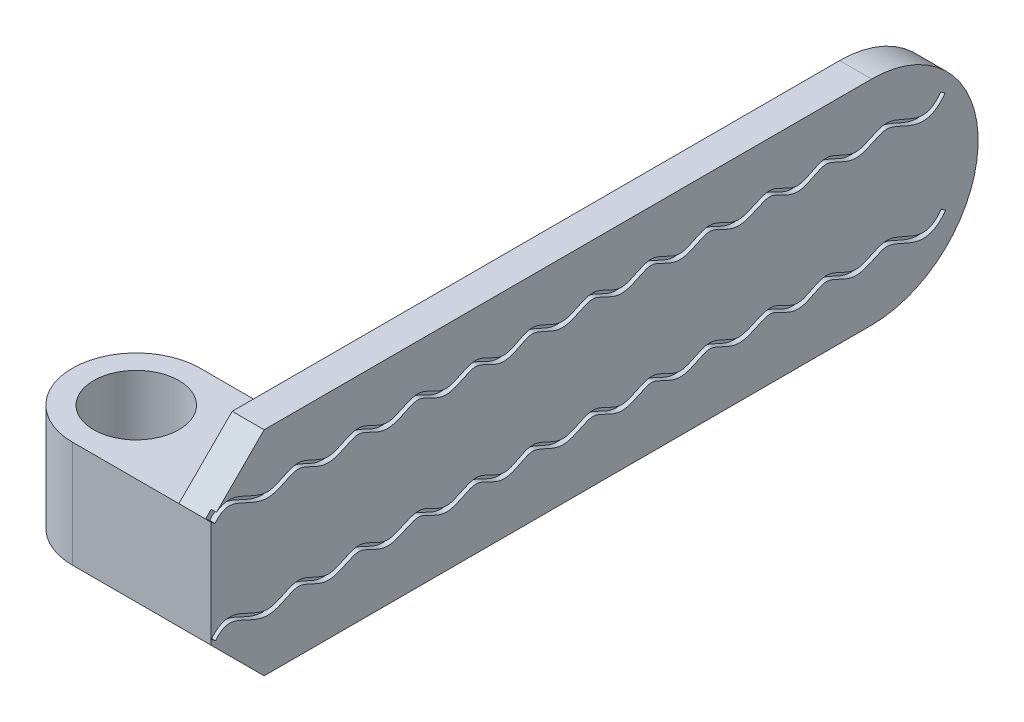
from build123d import *

# Parameters (mm, degrees)
SKETCH1_R                = 8
BOSS_EXTRUDE1_DEPTH      = 40
FILLET4_R                = 10
CUT_EXTRUDE11_DEPTH      = 155.20765221
CUT_EXTRUDE11_DEPTH_BACK = 155.20765221
CUT_EXTRUDE12_DEPTH      = 10
CUT_EXTRUDE13_START      = -20
CUT_EXTRUDE13_DEPTH      = 10
CHAMFER1_SIZE            = 10
CUT_EXTRUDE14_DEPTH      = 1
CUT_EXTRUDE18_DEPTH      = 1


with BuildPart() as part:
    # Sketch1 → Boss-Extrude1 (new body)
    with BuildSketch(Plane(origin=(0, 0, 0), x_dir=(1, 0, 0), z_dir=(0, 1, 0))):
        with BuildLine():
            Line((0, 0), (0, 144))
            Line((0, 144), (-6, 144))
            Line((-6, 144), (-6, 24))
            Line((-6, 24), (-26, 24))
            ThreePointArc((-26, 24), (-38, 12), (-26, 0))
            Line((-26, 0), (0, 0))
        make_face()
        with Locations(Location((-26, 12, 0), (0, 0, 270))):
            Circle(SKETCH1_R, mode=Mode.SUBTRACT)
    extrude(amount=BOSS_EXTRUDE1_DEPTH)

    # Fillet4
    fillet4_edges = [part.edges().sort_by_distance(p)[0] for p in [
        (-6, 20, -24),
    ]]
    fillet(fillet4_edges, radius=FILLET4_R)

    # Sketch15 → Cut-Extrude11 (cut, two sides: drawn at the far end of the back side and taken through both)
    with BuildSketch(Plane(origin=(0, 0, 0), x_dir=(0, 0, -1), z_dir=(1, 0, 0)).offset(-CUT_EXTRUDE11_DEPTH_BACK)):
        with BuildLine():
            Line((144, 40), (124, 40))
            ThreePointArc((124, 40), (138.142135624, 34.142135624), (144, 20))
            Line((144, 20), (144, 40))
        make_face()
        with BuildLine():
            ThreePointArc((144, 20), (138.142135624, 5.857864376), (124, 0))
            Line((124, 0), (144, 0))
            Line((144, 0), (144, 20))
        make_face()
    extrude(amount=CUT_EXTRUDE11_DEPTH + CUT_EXTRUDE11_DEPTH_BACK, mode=Mode.SUBTRACT)

    # Sketch16 → Cut-Extrude12 (cut)
    with BuildSketch(Plane.XZ):
        with BuildLine():
            Line((-6, -34), (-6, 0))
            Line((-6, 0), (-26, 0))
            ThreePointArc((-26, 0), (-38, -12), (-26, -24))
            Line((-26, -24), (-16, -24))
            ThreePointArc((-16, -24), (-8.928932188, -26.928932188), (-6, -34))
        make_face()
    extrude(amount=-CUT_EXTRUDE12_DEPTH, mode=Mode.SUBTRACT)

    # Sketch19 → Cut-Extrude13 (cut)
    with BuildSketch(Plane.XZ.offset(-10).offset(CUT_EXTRUDE13_START)):
        with BuildLine():
            Line((-6, -34), (-6, 0))
            Line((-6, 0), (-26, 0))
            ThreePointArc((-26, 0), (-38, -12), (-26, -24))
            Line((-26, -24), (-16, -24))
            ThreePointArc((-16, -24), (-8.928932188, -26.928932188), (-6, -34))
        make_face()
    extrude(amount=-CUT_EXTRUDE13_DEPTH, mode=Mode.SUBTRACT)

    # Chamfer1
    chamfer1_edges = [part.edges().sort_by_distance(p)[0] for p in [
        (-3, 0, 0),
        (-3, 40, 0),
    ]]
    chamfer(chamfer1_edges, length=CHAMFER1_SIZE)

    # Sketch20 → Cut-Extrude14 (cut)
    with BuildSketch(Plane(origin=(0, 0, 0), x_dir=(0, 0, -1), z_dir=(1, 0, 0))):
        with BuildLine():
            Line((0.776930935, 29.370414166), (0, 30))
            add(Edge.make_bspline(
                [(0, 30), (3.763740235, 34.644587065), (9.166121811, 26.57000185), (16.44944726, 33.101045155), (22.025867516, 27.827219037), (27.61122792, 33.168170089), (33.206558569, 27.793673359), (38.773898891, 33.216799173), (44.217392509, 27.865926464), (49.633686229, 33.248501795), (54.968754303, 27.927968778), (60.322203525, 33.21582741), (65.949301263, 27.756944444), (71.594170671, 33.180481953), (77.097462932, 27.852014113), (82.581691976, 33.2065582), (88.042244, 27.870086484), (93.510832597, 33.184680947), (99.158724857, 27.750006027), (104.781592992, 33.231173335), (110.102536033, 27.949227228), (115.414774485, 33.21564974), (120.920175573, 27.901594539), (128.112170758, 34.423575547), (133.516752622, 26.562032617), (136.974013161, 31.414097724)],
                knots=[0, 0, 0, 0, 0.079610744, 0.118990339, 0.159935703, 0.201599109, 0.240264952, 0.284224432, 0.320626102, 0.362643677, 0.40095846, 0.438525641, 0.481299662, 0.522825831, 0.561627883, 0.602908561, 0.64195451, 0.682146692, 0.722277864, 0.766455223, 0.802643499, 0.841506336, 0.882971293, 0.922429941, 1, 1, 1, 1], degree=3))
            Line((136.974013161, 31.414097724), (137.788420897, 30.83380466))
            add(Edge.make_bspline(
                [(0.776930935, 29.370414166), (0.855155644, 29.466946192), (1.0215759, 29.661812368), (1.333973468, 29.987769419), (1.712115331, 30.314487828), (2.135538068, 30.586413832), (2.668243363, 30.821610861), (3.304414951, 30.931190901), (4.142360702, 30.840879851), (5.080222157, 30.54262554), (6.43105463, 29.94335321), (7.895391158, 29.197977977), (9.507486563, 28.686002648), (10.842467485, 28.543194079), (12.198235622, 28.830543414), (13.359785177, 29.328178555), (14.433244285, 29.854010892), (15.404944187, 30.268494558), (16.096488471, 30.421433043), (16.561684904, 30.413930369), (17.094276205, 30.3208766), (17.862643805, 30.042596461), (18.902340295, 29.539455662), (20.040903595, 29.015227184), (21.307629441, 28.611207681), (22.77188636, 28.627762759), (24.027721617, 29.044544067), (25.165240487, 29.571851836), (26.19850462, 30.069634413), (27.129156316, 30.38922934), (27.819127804, 30.450661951), (28.62553527, 30.242669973), (29.607655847, 29.791628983), (30.690528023, 29.239553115), (31.698190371, 28.831099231), (32.59403165, 28.640149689), (33.563377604, 28.603633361), (34.667433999, 28.853926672), (35.85213834, 29.347244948), (36.937938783, 29.871343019), (37.924797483, 30.282380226), (38.756265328, 30.459995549), (39.421138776, 30.380693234), (40.339692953, 30.009193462), (41.372210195, 29.456876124), (42.518297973, 28.901091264), (43.648527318, 28.601037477), (44.620306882, 28.638369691), (45.509374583, 28.822277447), (46.522136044, 29.221861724), (47.621906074, 29.76765068), (48.623017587, 30.223134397), (49.476826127, 30.446556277), (50.134055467, 30.40165454), (51.042642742, 30.069263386), (52.068387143, 29.537995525), (53.206927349, 28.980076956), (54.281995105, 28.643828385), (55.268873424, 28.615750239), (56.1928389, 28.777069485), (57.214170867, 29.183681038), (58.305391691, 29.755349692), (59.29029605, 30.2321621), (59.969278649, 30.418472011), (60.420855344, 30.424480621), (60.948083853, 30.347512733), (61.709632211, 30.087445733), (62.745897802, 29.596272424), (63.880678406, 29.069160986), (65.127100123, 28.645261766), (66.589471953, 28.596228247), (67.873581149, 28.988051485), (69.019796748, 29.510868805), (70.067467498, 30.020715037), (70.841262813, 30.309543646), (71.380793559, 30.411151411), (71.84011476, 30.42750478), (72.49772981, 30.278284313), (73.468622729, 29.844247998), (74.542709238, 29.292536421), (75.540130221, 28.870749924), (76.421948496, 28.659634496), (77.390874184, 28.590960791), (78.519799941, 28.834555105), (79.700210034, 29.339515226), (80.77787095, 29.876956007), (81.750296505, 30.291533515), (82.422195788, 30.429647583), (82.874369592, 30.406718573), (83.408217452, 30.293371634), (84.181700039, 29.981185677), (85.231560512, 29.444119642), (86.38733553, 28.909017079), (87.491869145, 28.614298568), (88.468821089, 28.63273102), (89.36642667, 28.809182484), (90.382359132, 29.206594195), (91.478937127, 29.755921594), (92.475713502, 30.216596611), (93.315465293, 30.444277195), (93.985591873, 30.401161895), (94.896626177, 30.092135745), (95.91826297, 29.591578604), (97.04726353, 29.054111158), (98.307516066, 28.625165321), (99.7737823, 28.611508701), (101.041078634, 29.004156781), (102.193347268, 29.519841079), (103.248285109, 30.022279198), (104.197781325, 30.368803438), (104.836219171, 30.449247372), (105.294991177, 30.384976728), (105.846620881, 30.221500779), (106.639129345, 29.845998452), (107.709222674, 29.266501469), (108.711623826, 28.831510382), (109.61947526, 28.632356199), (110.610936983, 28.613114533), (111.707518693, 28.917260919), (112.862587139, 29.461961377), (113.905415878, 30.003533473), (114.844351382, 30.371779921), (115.526462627, 30.456468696), (116.341564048, 30.27668243), (117.321845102, 29.856906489), (118.403582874, 29.322898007), (119.579648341, 28.825427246), (120.955914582, 28.544644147), (122.350477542, 28.775734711), (123.535228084, 29.252574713), (124.623027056, 29.785304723), (125.617679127, 30.230028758), (126.453221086, 30.455067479), (127.209908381, 30.428255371), (128.123374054, 30.189953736), (129.118006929, 29.77835481), (130.539859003, 29.114774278), (132.085907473, 28.453174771), (133.853155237, 28.270781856), (135.260633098, 28.56359679), (136.378529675, 29.257773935), (137.19628593, 30.060513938), (137.604331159, 30.575445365), (137.788420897, 30.83380466)],
                knots=[0, 0, 0, 0, 0.001953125, 0.00390625, 0.0078125, 0.01171875, 0.015625, 0.0234375, 0.03125, 0.0390625, 0.046875, 0.0625, 0.0703125, 0.078125, 0.0859375, 0.09375, 0.1015625, 0.109375, 0.1171875, 0.12109375, 0.125, 0.1328125, 0.140625, 0.1484375, 0.15625, 0.1640625, 0.171875, 0.1796875, 0.1875, 0.1953125, 0.203125, 0.2109375, 0.21875, 0.2265625, 0.234375, 0.23828125, 0.2421875, 0.25, 0.2578125, 0.265625, 0.2734375, 0.28125, 0.2890625, 0.296875, 0.3046875, 0.3125, 0.3203125, 0.32421875, 0.328125, 0.3359375, 0.34375, 0.3515625, 0.359375, 0.3671875, 0.375, 0.3828125, 0.390625, 0.3984375, 0.40234375, 0.40625, 0.4140625, 0.421875, 0.4296875, 0.4375, 0.44140625, 0.4453125, 0.453125, 0.4609375, 0.46875, 0.4765625, 0.484375, 0.4921875, 0.5, 0.5078125, 0.515625, 0.51953125, 0.5234375, 0.53125, 0.5390625, 0.546875, 0.5546875, 0.55859375, 0.5625, 0.5703125, 0.578125, 0.5859375, 0.59375, 0.6015625, 0.60546875, 0.609375, 0.6171875, 0.625, 0.6328125, 0.640625, 0.64453125, 0.6484375, 0.65625, 0.6640625, 0.671875, 0.6796875, 0.6875, 0.6953125, 0.703125, 0.7109375, 0.71875, 0.7265625, 0.734375, 0.7421875, 0.75, 0.7578125, 0.765625, 0.76953125, 0.7734375, 0.78125, 0.7890625, 0.796875, 0.80078125, 0.8046875, 0.8125, 0.8203125, 0.828125, 0.8359375, 0.84375, 0.8515625, 0.859375, 0.8671875, 0.875, 0.8828125, 0.890625, 0.8984375, 0.90625, 0.9140625, 0.921875, 0.9296875, 0.9375, 0.9453125, 0.953125, 0.96875, 0.9765625, 0.984375, 0.9921875, 0.99609375, 1, 1, 1, 1], degree=3))
        make_face()
    extrude(amount=-CUT_EXTRUDE14_DEPTH, mode=Mode.SUBTRACT)

    # Sketch21 → Cut-Extrude18 (cut)
    with BuildSketch(Plane(origin=(0, 0, 0), x_dir=(0, 0, -1), z_dir=(1, 0, 0))):
        with BuildLine():
            Line((0.088154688, 10.898794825), (0.865085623, 10.269208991))
            add(Edge.make_bspline(
                [(0.865085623, 10.269208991), (0.943310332, 10.365741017), (1.109730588, 10.560607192), (1.422128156, 10.886564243), (1.800270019, 11.213282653), (2.223692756, 11.485208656), (2.756398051, 11.720405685), (3.392569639, 11.829985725), (4.23051539, 11.739674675), (5.168376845, 11.441420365), (6.519209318, 10.842148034), (7.983545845, 10.096772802), (9.595641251, 9.584797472), (10.930622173, 9.441988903), (12.28639031, 9.729338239), (13.447939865, 10.22697338), (14.521398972, 10.752805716), (15.493098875, 11.167289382), (16.184643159, 11.320227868), (16.649839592, 11.312725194), (17.182430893, 11.219671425), (17.950798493, 10.941391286), (18.990494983, 10.438250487), (20.129058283, 9.914022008), (21.395784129, 9.510002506), (22.860041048, 9.526557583), (24.115876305, 9.943338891), (25.253395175, 10.47064666), (26.286659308, 10.968429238), (27.217311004, 11.288024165), (27.907282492, 11.349456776), (28.713689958, 11.141464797), (29.695810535, 10.690423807), (30.77868271, 10.138347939), (31.786345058, 9.729894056), (32.682186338, 9.538944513), (33.651532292, 9.502428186), (34.755588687, 9.752721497), (35.940293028, 10.246039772), (37.026093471, 10.770137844), (38.012952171, 11.181175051), (38.844420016, 11.358790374), (39.509293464, 11.279488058), (40.427847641, 10.907988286), (41.460364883, 10.355670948), (42.606452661, 9.799886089), (43.736682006, 9.499832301), (44.70846157, 9.537164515), (45.597529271, 9.721072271), (46.610290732, 10.120656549), (47.710060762, 10.666445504), (48.711172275, 11.121929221), (49.564980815, 11.345351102), (50.222210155, 11.300449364), (51.13079743, 10.96805821), (52.156541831, 10.436790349), (53.295082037, 9.87887178), (54.370149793, 9.542623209), (55.357028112, 9.514545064), (56.280993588, 9.67586431), (57.302325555, 10.082475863), (58.393546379, 10.654144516), (59.378450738, 11.130956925), (60.057433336, 11.317266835), (60.509010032, 11.323275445), (61.036238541, 11.246307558), (61.797786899, 10.986240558), (62.83405249, 10.495067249), (63.968833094, 9.967955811), (65.215254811, 9.54405659), (66.677626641, 9.495023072), (67.961735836, 9.88684631), (69.107951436, 10.40966363), (70.155622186, 10.919509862), (70.9294175, 11.208338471), (71.468948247, 11.309946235), (71.928269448, 11.326299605), (72.585884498, 11.177079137), (73.556777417, 10.743042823), (74.630863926, 10.191331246), (75.628284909, 9.769544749), (76.510103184, 9.558429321), (77.479028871, 9.489755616), (78.607954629, 9.733349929), (79.788364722, 10.238310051), (80.866025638, 10.775750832), (81.838451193, 11.190328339), (82.510350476, 11.328442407), (82.96252428, 11.305513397), (83.49637214, 11.192166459), (84.269854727, 10.879980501), (85.3197152, 10.342914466), (86.475490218, 9.807811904), (87.580023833, 9.513093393), (88.556975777, 9.531525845), (89.454581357, 9.707977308), (90.47051382, 10.105389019), (91.567091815, 10.654716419), (92.56386819, 11.115391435), (93.403619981, 11.343072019), (94.07374656, 11.299956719), (94.984780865, 10.990930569), (96.006417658, 10.490373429), (97.135418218, 9.952905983), (98.395670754, 9.523960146), (99.861936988, 9.510303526), (101.129233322, 9.902951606), (102.281501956, 10.418635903), (103.336439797, 10.921074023), (104.285936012, 11.267598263), (104.924373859, 11.348042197), (105.383145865, 11.283771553), (105.934775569, 11.120295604), (106.727284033, 10.744793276), (107.797377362, 10.165296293), (108.799778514, 9.730305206), (109.707629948, 9.531151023), (110.699091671, 9.511909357), (111.79567338, 9.816055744), (112.950741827, 10.360756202), (113.993570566, 10.902328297), (114.93250607, 11.270574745), (115.614617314, 11.35526352), (116.429718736, 11.175477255), (117.409999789, 10.755701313), (118.491737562, 10.221692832), (119.667803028, 9.724222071), (121.04406927, 9.443438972), (122.43863223, 9.674529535), (123.623382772, 10.151369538), (124.711181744, 10.684099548), (125.705833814, 11.128823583), (126.541375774, 11.353862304), (127.298063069, 11.327050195), (128.211528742, 11.088748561), (129.206161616, 10.677149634), (130.628013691, 10.013569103), (132.174062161, 9.351969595), (133.941309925, 9.16957668), (135.348787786, 9.462391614), (136.466684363, 10.15656876), (137.284440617, 10.959308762), (137.692485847, 11.47424019), (137.876575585, 11.732599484)],
                knots=[0, 0, 0, 0, 0.001953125, 0.00390625, 0.0078125, 0.01171875, 0.015625, 0.0234375, 0.03125, 0.0390625, 0.046875, 0.0625, 0.0703125, 0.078125, 0.0859375, 0.09375, 0.1015625, 0.109375, 0.1171875, 0.12109375, 0.125, 0.1328125, 0.140625, 0.1484375, 0.15625, 0.1640625, 0.171875, 0.1796875, 0.1875, 0.1953125, 0.203125, 0.2109375, 0.21875, 0.2265625, 0.234375, 0.23828125, 0.2421875, 0.25, 0.2578125, 0.265625, 0.2734375, 0.28125, 0.2890625, 0.296875, 0.3046875, 0.3125, 0.3203125, 0.32421875, 0.328125, 0.3359375, 0.34375, 0.3515625, 0.359375, 0.3671875, 0.375, 0.3828125, 0.390625, 0.3984375, 0.40234375, 0.40625, 0.4140625, 0.421875, 0.4296875, 0.4375, 0.44140625, 0.4453125, 0.453125, 0.4609375, 0.46875, 0.4765625, 0.484375, 0.4921875, 0.5, 0.5078125, 0.515625, 0.51953125, 0.5234375, 0.53125, 0.5390625, 0.546875, 0.5546875, 0.55859375, 0.5625, 0.5703125, 0.578125, 0.5859375, 0.59375, 0.6015625, 0.60546875, 0.609375, 0.6171875, 0.625, 0.6328125, 0.640625, 0.64453125, 0.6484375, 0.65625, 0.6640625, 0.671875, 0.6796875, 0.6875, 0.6953125, 0.703125, 0.7109375, 0.71875, 0.7265625, 0.734375, 0.7421875, 0.75, 0.7578125, 0.765625, 0.76953125, 0.7734375, 0.78125, 0.7890625, 0.796875, 0.80078125, 0.8046875, 0.8125, 0.8203125, 0.828125, 0.8359375, 0.84375, 0.8515625, 0.859375, 0.8671875, 0.875, 0.8828125, 0.890625, 0.8984375, 0.90625, 0.9140625, 0.921875, 0.9296875, 0.9375, 0.9453125, 0.953125, 0.96875, 0.9765625, 0.984375, 0.9921875, 0.99609375, 1, 1, 1, 1], degree=3))
            Line((137.876575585, 11.732599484), (137.062167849, 12.312892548))
            add(Edge.make_bspline(
                [(137.062167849, 12.312892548), (133.60490731, 7.460827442), (128.200325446, 15.322370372), (121.008330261, 8.800389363), (115.502929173, 14.114444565), (110.19069072, 8.848022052), (104.86974768, 14.129968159), (99.246879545, 8.648800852), (93.598987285, 14.083475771), (88.130398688, 8.768881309), (82.669846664, 14.105353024), (77.18561762, 8.750808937), (71.682325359, 14.079276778), (66.037455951, 8.655739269), (60.410358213, 14.114622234), (55.05690899, 8.826763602), (49.721840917, 14.14729662), (44.305547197, 8.764721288), (38.862053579, 14.115593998), (33.294713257, 8.692468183), (27.699382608, 14.066964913), (22.114022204, 8.726013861), (16.537601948, 13.99983998), (9.254276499, 7.468796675), (3.851894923, 15.543381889), (0.088154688, 10.898794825)],
                knots=[0, 0, 0, 0, 0.077570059, 0.117028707, 0.158493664, 0.197356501, 0.233544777, 0.277722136, 0.317853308, 0.35804549, 0.397091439, 0.438372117, 0.477174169, 0.518700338, 0.561474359, 0.59904154, 0.637356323, 0.679373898, 0.715775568, 0.759735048, 0.798400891, 0.840064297, 0.881009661, 0.920389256, 1, 1, 1, 1], degree=3))
        make_face()
    extrude(amount=-CUT_EXTRUDE18_DEPTH, mode=Mode.SUBTRACT)


solid = part.part
